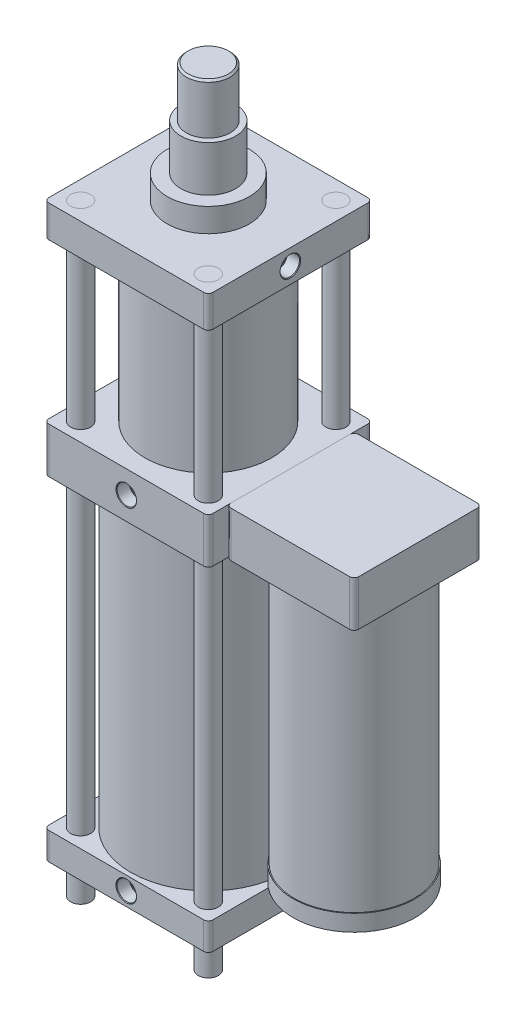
from build123d import *

# Parameters (mm, degrees)
SKETCH_1_R              = 11
EXTRUDE_1_DEPTH         = 35
SKETCH_2_R              = 45
EXTRUDE_2_DEPTH         = 26
SKETCH_3_R              = 30
EXTRUDE_3_DEPTH         = 50
SKETCH_4_R              = 24
EXTRUDE_4_DEPTH         = 55
CHAMFER_1_SIZE          = 2
SKETCH_5_R              = 69.5
EXTRUDE_5_DEPTH         = 175
EXTRUDE_START           = 50
SKETCH_6_R              = 11
EXTRUDE_6_DEPTH         = 50
SKETCH_7_R              = 85
EXTRUDE_7_DEPTH         = 336
EXTRUDE_START_2         = 30
SKETCH_8_R              = 11
EXTRUDE_8_DEPTH         = 30
EXTRUDE_9_DEPTH         = 50
SKETCH_10_R             = 66
EXTRUDE_10_DEPTH        = 290
SKETCH_11_R             = 67
EXTRUDE_11_DEPTH        = 18
EXTRUDE_12_DEPTH        = 12
EXTRUDE_13_DEPTH        = 35
EXTRUDE_13_DEPTH_BACK   = 626
SKETCH_13_R             = 11
EXTRUDE_13_2_DEPTH      = 35
EXTRUDE_13_2_DEPTH_BACK = 626
EXTRUDE_13_3_DEPTH      = 35
EXTRUDE_13_3_DEPTH_BACK = 626
EXTRUDE_13_4_DEPTH      = 35
EXTRUDE_13_4_DEPTH_BACK = 626
F_1_2_NPT_2_AT_2_COUNT  = 2
F_1_2_NPT_2_AT_2_PITCH  = 376


with BuildPart() as part:
    # Sketch 1 → Extrude 1 (new body)
    with BuildSketch(Plane(origin=(0, 0, 0), x_dir=(1, 0, 0), z_dir=(0, 1, 0))):
        with BuildLine():
            Line((85, 90), (-85, 90))
            ThreePointArc((-85, 90), (-88.535533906, 88.535533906), (-90, 85))
            Line((-90, 85), (-90, -85))
            ThreePointArc((-90, -85), (-88.535533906, -88.535533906), (-85, -90))
            Line((-85, -90), (85, -90))
            ThreePointArc((85, -90), (88.535533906, -88.535533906), (90, -85))
            Line((90, -85), (90, 85))
            ThreePointArc((90, 85), (88.535533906, 88.535533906), (85, 90))
        make_face()
        with Locations(Location((70, -70, 0), (0, 0, 270))):
            Circle(SKETCH_1_R, mode=Mode.SUBTRACT)
        with Locations(Location((-70, -70, 0), (0, 0, 270))):
            Circle(SKETCH_1_R, mode=Mode.SUBTRACT)
        with Locations(Location((-70, 70, 0), (0, 0, 270))):
            Circle(SKETCH_1_R, mode=Mode.SUBTRACT)
        with Locations(Location((70, 70, 0), (0, 0, 270))):
            Circle(SKETCH_1_R, mode=Mode.SUBTRACT)
    extrude(amount=EXTRUDE_1_DEPTH)

    # Sketch 2 → Extrude 2 (add)
    with BuildSketch(Plane(origin=(0, 35, 0), x_dir=(1, 0, 0), z_dir=(0, 1, 0))):
        with Locations(Location((0, 0, 0), (0, 0, 90))):
            Circle(SKETCH_2_R)
    extrude(amount=EXTRUDE_2_DEPTH)

    # Sketch 3 → Extrude 3 (add)
    with BuildSketch(Plane(origin=(0, 61, 0), x_dir=(1, 0, 0), z_dir=(0, 1, 0))):
        with Locations(Location((0, 0, 0), (0, 0, 270))):
            Circle(SKETCH_3_R)
    extrude(amount=EXTRUDE_3_DEPTH)

    # Sketch 4 → Extrude 4 (add)
    with BuildSketch(Plane(origin=(0, 111, 0), x_dir=(1, 0, 0), z_dir=(0, 1, 0))):
        with Locations(Location((0, 0, 0), (0, 0, 270))):
            Circle(SKETCH_4_R)
    extrude(amount=EXTRUDE_4_DEPTH)

    # Chamfer 1
    chamfer_1_edges = [part.edges().sort_by_distance(p)[0] for p in [
        (0, 166, -24),
    ]]
    chamfer(chamfer_1_edges, length=CHAMFER_1_SIZE)

    # Sketch 15 → 1_2 NPT _1 (revolve, cut)
    with BuildSketch(Plane(origin=(90, 17.5, 0), x_dir=(0, 0, -1), z_dir=(0, 1, 0))):
        Polygon((0, 0), (0, 28.004543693), (8.9281, 22.64), (8.9281, 13.57), (10.280670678, 13.57), (10.6679619, 0.635), (11.3029619, 0), align=None)
    revolve(axis=Axis((96.35, 17.5, 0), (-1, 0, 0)), mode=Mode.SUBTRACT)


with BuildPart() as body_2:
    # Sketch 5 → Extrude 5 (new body)
    with BuildSketch(Plane.XZ):
        with Locations(Location((0, 0, 0), (0, 0, 270))):
            Circle(SKETCH_5_R)
    extrude(amount=EXTRUDE_5_DEPTH)

    # Sketch 6 → Extrude 6 (add)
    with BuildSketch(Plane.XZ.offset(175).offset(EXTRUDE_START)):
        with BuildLine():
            Line((85, -90), (-85, -90))
            ThreePointArc((-85, -90), (-88.535533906, -88.535533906), (-90, -85))
            Line((-90, -85), (-90, 85))
            ThreePointArc((-90, 85), (-88.535533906, 88.535533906), (-85, 90))
            Line((-85, 90), (85, 90))
            ThreePointArc((85, 90), (88.535533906, 88.535533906), (90, 85))
            Line((90, 85), (90, -85))
            ThreePointArc((90, -85), (88.535533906, -88.535533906), (85, -90))
        make_face()
        with Locations(Location((70, -70, 0), (0, 0, 270))):
            Circle(SKETCH_6_R, mode=Mode.SUBTRACT)
        with Locations(Location((-70, -70, 0), (0, 0, 270))):
            Circle(SKETCH_6_R, mode=Mode.SUBTRACT)
        with Locations(Location((70, 70, 0), (0, 0, 270))):
            Circle(SKETCH_6_R, mode=Mode.SUBTRACT)
        with Locations(Location((-70, 70, 0), (0, 0, 270))):
            Circle(SKETCH_6_R, mode=Mode.SUBTRACT)
    extrude(amount=-EXTRUDE_6_DEPTH)

    # Sketch 7 → Extrude 7 (add)
    with BuildSketch(Plane.XZ.offset(225)):
        with Locations(Location((0, 0, 0), (0, 0, 90))):
            Circle(SKETCH_7_R)
    extrude(amount=EXTRUDE_7_DEPTH)

    # Sketch 8 → Extrude 8 (add)
    with BuildSketch(Plane.XZ.offset(561).offset(EXTRUDE_START_2)):
        with BuildLine():
            Line((-85, -90), (85, -90))
            ThreePointArc((85, -90), (88.535533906, -88.535533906), (90, -85))
            Line((90, -85), (90, 85))
            ThreePointArc((90, 85), (88.535533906, 88.535533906), (85, 90))
            Line((85, 90), (-85, 90))
            ThreePointArc((-85, 90), (-88.535533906, 88.535533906), (-90, 85))
            Line((-90, 85), (-90, -85))
            ThreePointArc((-90, -85), (-88.535533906, -88.535533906), (-85, -90))
        make_face()
        with Locations(Location((-70, -70, 0), (0, 0, 270))):
            Circle(SKETCH_8_R, mode=Mode.SUBTRACT)
        with Locations(Location((70, -70, 0), (0, 0, 270))):
            Circle(SKETCH_8_R, mode=Mode.SUBTRACT)
        with Locations(Location((70, 70, 0), (0, 0, 270))):
            Circle(SKETCH_8_R, mode=Mode.SUBTRACT)
        with Locations(Location((-70, 70, 0), (0, 0, 270))):
            Circle(SKETCH_8_R, mode=Mode.SUBTRACT)
    extrude(amount=-EXTRUDE_8_DEPTH)

    # Sketch 17 → 1_2 NPT _2 (revolve, cut)
    with BuildSketch(Plane(origin=(0, -200, 90), x_dir=(0, -1, 0), z_dir=(1, 0, 0))):
        Polygon((0, 0), (0, 28.004543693), (8.9281, 22.64), (8.9281, 13.57), (10.280670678, 13.57), (10.6679619, 0.635), (11.3029619, 0), align=None)
    f_1_2_npt_2 = revolve(axis=Axis((0, -200, 96.35), (0, 0, -1)), mode=Mode.SUBTRACT)

    # 1_2 NPT _2 at 2: 1_2 NPT _2 ×2
    with Locations(*[(0, -i * F_1_2_NPT_2_AT_2_PITCH, 0) for i in range(1, F_1_2_NPT_2_AT_2_COUNT)]):
        add(f_1_2_npt_2, mode=Mode.SUBTRACT)

    # Sketch 21 → 1_4 NPT _1 (revolve, cut)
    with BuildSketch(Plane(origin=(-90, -200, 0), x_dir=(0, 0, 1), z_dir=(0, 1, 0))):
        Polygon((0, 0), (0, 20.412347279), (5.5626, 17.07), (5.5626, 10.02), (6.576987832, 10.02), (6.8579873, 0.635), (7.4929873, 0), align=None)
    revolve(axis=Axis((-96.35, -200, 0), (1, 0, 0)), mode=Mode.SUBTRACT)

    # Sketch 23 → 1_4 NPT _2 (revolve, cut)
    with BuildSketch(Plane(origin=(0, -200, -90), x_dir=(0, 1, 0), z_dir=(1, 0, 0))):
        Polygon((0, 0), (0, 20.412347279), (5.5626, 17.07), (5.5626, 10.02), (6.576987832, 10.02), (6.8579873, 0.635), (7.4929873, 0), align=None)
    revolve(axis=Axis((0, -200, -96.35), (0, 0, 1)), mode=Mode.SUBTRACT)


with BuildPart() as body_3:
    # Sketch 9 → Extrude 9 (new body)
    with BuildSketch(Plane(origin=(0, -175, 0), x_dir=(1, 0, 0), z_dir=(0, 1, 0))):
        with BuildLine():
            Line((225, -70), (95, -70))
            ThreePointArc((95, -70), (91.464466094, -68.535533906), (90, -65))
            Line((90, -65), (90, 65))
            ThreePointArc((90, 65), (91.464466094, 68.535533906), (95, 70))
            Line((95, 70), (225, 70))
            ThreePointArc((225, 70), (228.535533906, 68.535533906), (230, 65))
            Line((230, 65), (230, -65))
            ThreePointArc((230, -65), (228.535533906, -68.535533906), (225, -70))
        make_face()
    extrude(amount=-EXTRUDE_9_DEPTH)


with BuildPart() as body_4:
    # Sketch 10 → Extrude 10 (new body)
    with BuildSketch(Plane.XZ.offset(225)):
        with Locations(Location((160, 0, 0), (0, 0, 270))):
            Circle(SKETCH_10_R)
    extrude(amount=EXTRUDE_10_DEPTH)


with BuildPart() as body_5:
    # Sketch 11 → Extrude 11 (new body)
    with BuildSketch(Plane.XZ.offset(515)):
        with Locations(Location((160, 0, 0), (0, 0, 270))):
            Circle(SKETCH_11_R)
    extrude(amount=EXTRUDE_11_DEPTH)


with BuildPart() as body_6:
    # Sketch 12 → Extrude 12 (new body)
    with BuildSketch(Plane.XZ.offset(533)):
        Polygon((177.320508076, 0), (168.660254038, 15), (151.339745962, 15), (142.679491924, 0), (151.339745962, -15), (168.660254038, -15), align=None)
    extrude(amount=EXTRUDE_12_DEPTH)


with BuildPart() as body_7:
    # Sketch 13 → Extrude 13 (new, two sides: drawn at the far end of the back side and taken through both)
    with BuildSketch(Plane.XZ.offset(591).offset(-EXTRUDE_13_DEPTH_BACK)):
        with Locations(Location((-70, -70, 0), (0, 0, 90))):
            Circle(SKETCH_13_R)
    extrude(amount=EXTRUDE_13_DEPTH + EXTRUDE_13_DEPTH_BACK)


with BuildPart() as body_8:
    # Sketch 13 → Extrude 13 2 (new, two sides: drawn at the far end of the back side and taken through both)
    with BuildSketch(Plane.XZ.offset(591).offset(-EXTRUDE_13_2_DEPTH_BACK)):
        with Locations(Location((-70, 70, 0), (0, 0, 90))):
            Circle(SKETCH_13_R)
    extrude(amount=EXTRUDE_13_2_DEPTH + EXTRUDE_13_2_DEPTH_BACK)


with BuildPart() as body_9:
    # Sketch 13 → Extrude 13 3 (new, two sides: drawn at the far end of the back side and taken through both)
    with BuildSketch(Plane.XZ.offset(591).offset(-EXTRUDE_13_3_DEPTH_BACK)):
        with Locations(Location((70, -70, 0), (0, 0, 90))):
            Circle(SKETCH_13_R)
    extrude(amount=EXTRUDE_13_3_DEPTH + EXTRUDE_13_3_DEPTH_BACK)


with BuildPart() as body_10:
    # Sketch 13 → Extrude 13 4 (new, two sides: drawn at the far end of the back side and taken through both)
    with BuildSketch(Plane.XZ.offset(591).offset(-EXTRUDE_13_4_DEPTH_BACK)):
        with Locations(Location((70, 70, 0), (0, 0, 90))):
            Circle(SKETCH_13_R)
    extrude(amount=EXTRUDE_13_4_DEPTH + EXTRUDE_13_4_DEPTH_BACK)


with BuildPart() as f_1_2_npt_3_tool:
    # Sketch 19 → 1_2 NPT _3 (revolve)
    with BuildSketch(Plane(origin=(160, -545, 0), x_dir=(0, 0, -1), z_dir=(1, 0, 0))):
        Polygon((0, 0), (0, 28.004543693), (8.9281, 22.64), (8.9281, 13.57), (10.280670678, 13.57), (10.6679619, 0.635), (11.3029619, 0), align=None)
    revolve(axis=Axis((160, -551.35, 0), (0, 1, 0)))


with BuildPart() as body_5_1:
    add(body_5.part)

    # 1_2 NPT _3: cut by f_1_2_npt_3_tool
    add(f_1_2_npt_3_tool.part, mode=Mode.SUBTRACT)


with BuildPart() as body_6_1:
    add(body_6.part)

    # 1_2 NPT _3: cut by f_1_2_npt_3_tool
    add(f_1_2_npt_3_tool.part, mode=Mode.SUBTRACT)


solid = Compound([part.part, body_2.part, body_3.part, body_4.part, body_7.part, body_8.part, body_9.part, body_10.part, body_5_1.part, body_6_1.part])
